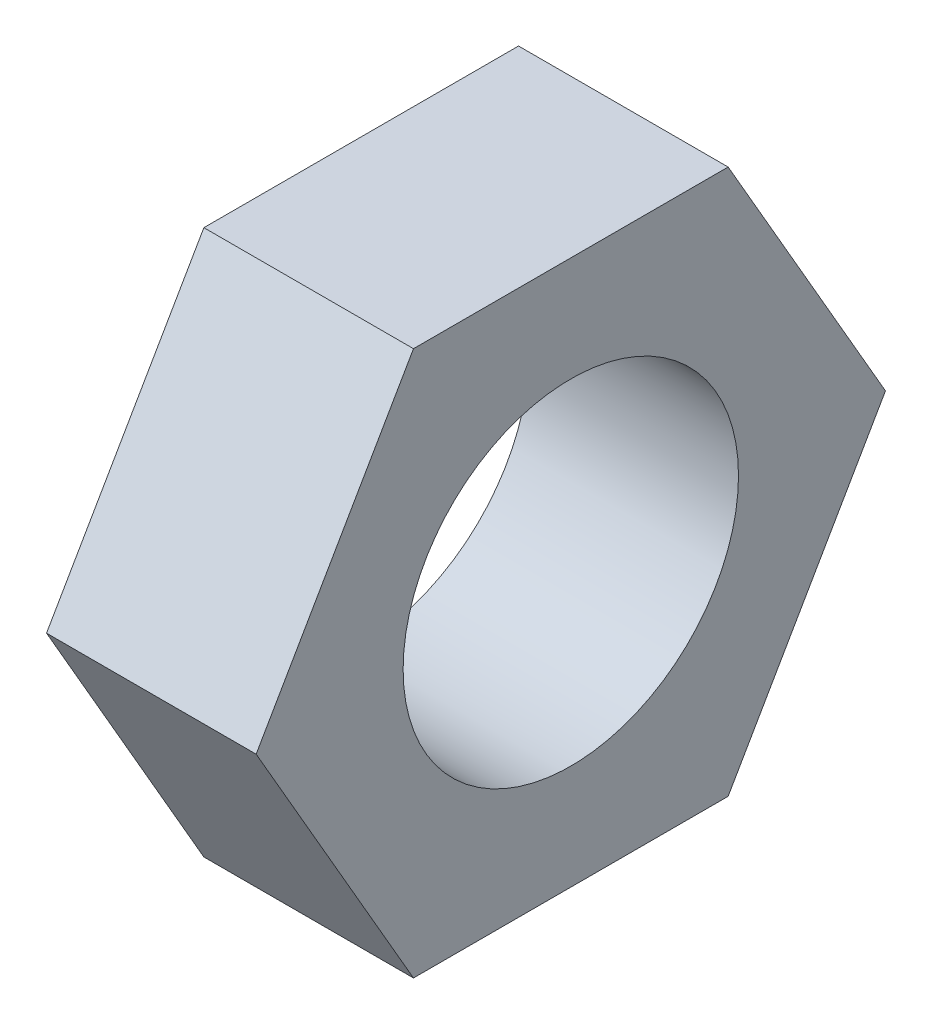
from build123d import *

# Parameters (mm, degrees)
SKETCH1_R      = 4
EXTRUDE1_DEPTH = 5


with BuildPart() as part:
    # Sketch1 → Extrude1 (new body)
    with BuildSketch(Plane(origin=(0, 0, 0), x_dir=(0, 0, -1), z_dir=(1, 0, 0))):
        Polygon((7.505553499, 0), (3.75277675, 6.5), (-3.75277675, 6.5), (-7.505553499, 0), (-3.75277675, -6.5), (3.75277675, -6.5), align=None)
        Circle(SKETCH1_R, mode=Mode.SUBTRACT)
    extrude(amount=EXTRUDE1_DEPTH)


solid = part.part
